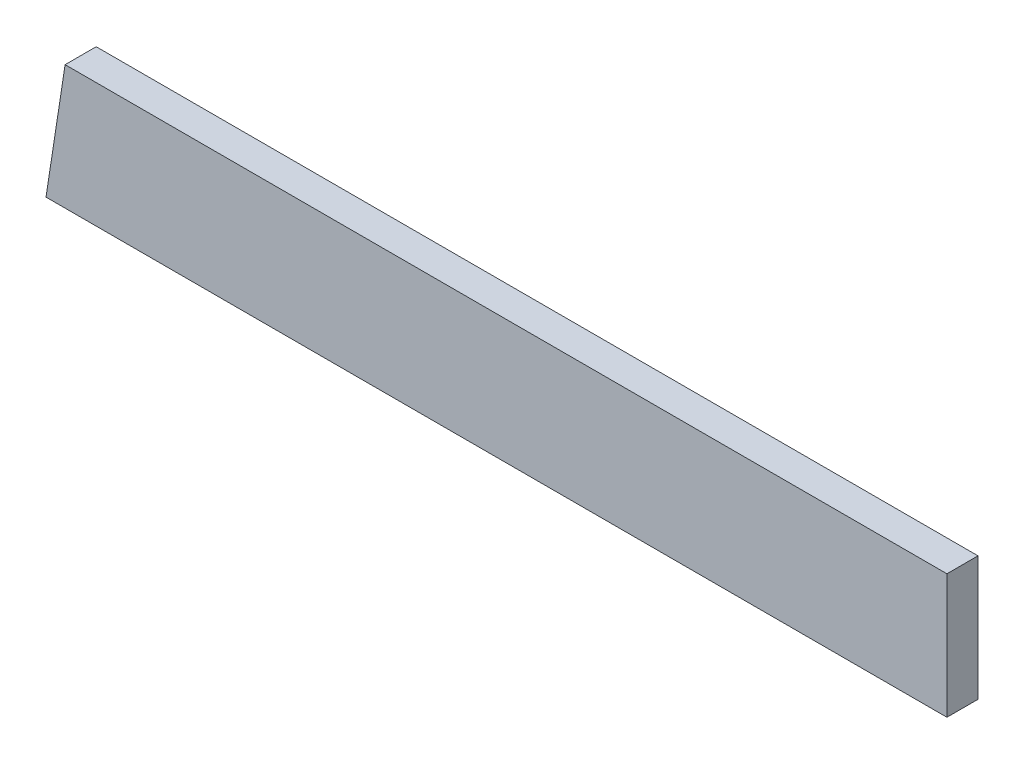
ISO-10303-21;
HEADER;
FILE_DESCRIPTION(('STEP AP214'),'2;1');
FILE_NAME('part.step','',(''),(''),'','','');
FILE_SCHEMA(('AUTOMOTIVE_DESIGN { 1 0 10303 214 1 1 1 1 }'));
ENDSEC;
DATA;
#1=APPLICATION_CONTEXT('core data for automotive mechanical design processes');
#2=APPLICATION_PROTOCOL_DEFINITION('international standard','automotive_design',2000,#1);
#3=PRODUCT_CONTEXT('',#1,'mechanical');
#4=PRODUCT('Part','Part','',(#3));
#5=PRODUCT_RELATED_PRODUCT_CATEGORY('part','',(#4));
#6=PRODUCT_DEFINITION_FORMATION('','',#4);
#7=PRODUCT_DEFINITION_CONTEXT('part definition',#1,'design');
#8=PRODUCT_DEFINITION('design','',#6,#7);
#9=PRODUCT_DEFINITION_SHAPE('','',#8);
#10=(LENGTH_UNIT() NAMED_UNIT(*) SI_UNIT(.MILLI.,.METRE.));
#11=(NAMED_UNIT(*) PLANE_ANGLE_UNIT() SI_UNIT($,.RADIAN.));
#12=(NAMED_UNIT(*) SI_UNIT($,.STERADIAN.) SOLID_ANGLE_UNIT());
#13=UNCERTAINTY_MEASURE_WITH_UNIT(LENGTH_MEASURE(1.E-05),#10,'distance_accuracy_value','');
#14=(GEOMETRIC_REPRESENTATION_CONTEXT(3) GLOBAL_UNCERTAINTY_ASSIGNED_CONTEXT((#13)) GLOBAL_UNIT_ASSIGNED_CONTEXT((#10,
#11,#12)) REPRESENTATION_CONTEXT('',''));
#15=CARTESIAN_POINT('',(0.,0.,0.));
#16=DIRECTION('',(0.,0.,1.));
#17=DIRECTION('',(1.,0.,0.));
#18=AXIS2_PLACEMENT_3D('',#15,#16,#17);
#19=CARTESIAN_POINT('',(-1101.96923076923,-1270.,25.4));
#20=DIRECTION('',(0.988371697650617,-0.152057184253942,0.));
#21=DIRECTION('',(0.152057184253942,0.988371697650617,0.));
#22=AXIS2_PLACEMENT_3D('',#19,#20,#21);
#23=PLANE('',#22);
#24=DIRECTION('',(-0.152057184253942,-0.988371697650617,0.));
#25=VECTOR('',#24,1.);
#26=CARTESIAN_POINT('',(-1101.96923076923,-1270.,0.));
#27=LINE('',#26,#25);
#28=CARTESIAN_POINT('',(-1101.96923076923,-1270.,0.));
#29=VERTEX_POINT('',#28);
#30=CARTESIAN_POINT('',(-1117.6,-1371.6,0.));
#31=VERTEX_POINT('',#30);
#32=EDGE_CURVE('E107',#29,#31,#27,.T.);
#33=ORIENTED_EDGE('',*,*,#32,.T.);
#34=DIRECTION('',(0.,0.,-1.));
#35=VECTOR('',#34,1.);
#36=CARTESIAN_POINT('',(-1117.6,-1371.6,25.4));
#37=LINE('',#36,#35);
#38=CARTESIAN_POINT('',(-1117.6,-1371.6,25.4));
#39=VERTEX_POINT('',#38);
#40=EDGE_CURVE('E11',#39,#31,#37,.T.);
#41=ORIENTED_EDGE('',*,*,#40,.F.);
#42=DIRECTION('',(-0.152057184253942,-0.988371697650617,0.));
#43=VECTOR('',#42,1.);
#44=CARTESIAN_POINT('',(-1101.96923076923,-1270.,25.4));
#45=LINE('',#44,#43);
#46=CARTESIAN_POINT('',(-1101.96923076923,-1270.,25.4));
#47=VERTEX_POINT('',#46);
#48=EDGE_CURVE('E89',#47,#39,#45,.T.);
#49=ORIENTED_EDGE('',*,*,#48,.F.);
#50=DIRECTION('',(0.,0.,-1.));
#51=VECTOR('',#50,1.);
#52=CARTESIAN_POINT('',(-1101.96923076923,-1270.,25.4));
#53=LINE('',#52,#51);
#54=EDGE_CURVE('E56',#47,#29,#53,.T.);
#55=ORIENTED_EDGE('',*,*,#54,.T.);
#56=EDGE_LOOP('',(#33,#41,#49,#55));
#57=FACE_BOUND('',#56,.T.);
#58=ADVANCED_FACE('F39',(#57),#23,.F.);
#59=CARTESIAN_POINT('',(-1117.6,-1371.6,25.4));
#60=DIRECTION('',(0.,1.,0.));
#61=DIRECTION('',(0.,0.,1.));
#62=AXIS2_PLACEMENT_3D('',#59,#60,#61);
#63=PLANE('',#62);
#64=DIRECTION('',(1.,0.,0.));
#65=VECTOR('',#64,1.);
#66=CARTESIAN_POINT('',(-1117.6,-1371.6,0.));
#67=LINE('',#66,#65);
#68=CARTESIAN_POINT('',(-381.117230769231,-1371.6,0.));
#69=VERTEX_POINT('',#68);
#70=EDGE_CURVE('E95',#31,#69,#67,.T.);
#71=ORIENTED_EDGE('',*,*,#70,.T.);
#72=DIRECTION('',(0.,0.,-1.));
#73=VECTOR('',#72,1.);
#74=CARTESIAN_POINT('',(-381.117230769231,-1371.6,25.4));
#75=LINE('',#74,#73);
#76=CARTESIAN_POINT('',(-381.117230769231,-1371.6,25.4));
#77=VERTEX_POINT('',#76);
#78=EDGE_CURVE('E48',#77,#69,#75,.T.);
#79=ORIENTED_EDGE('',*,*,#78,.F.);
#80=DIRECTION('',(1.,0.,0.));
#81=VECTOR('',#80,1.);
#82=CARTESIAN_POINT('',(-1117.6,-1371.6,25.4));
#83=LINE('',#82,#81);
#84=EDGE_CURVE('E81',#39,#77,#83,.T.);
#85=ORIENTED_EDGE('',*,*,#84,.F.);
#86=ORIENTED_EDGE('',*,*,#40,.T.);
#87=EDGE_LOOP('',(#71,#79,#85,#86));
#88=FACE_BOUND('',#87,.T.);
#89=ADVANCED_FACE('F94',(#88),#63,.F.);
#90=CARTESIAN_POINT('',(-381.117230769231,-1270.,25.4));
#91=DIRECTION('',(1.,0.,0.));
#92=DIRECTION('',(0.,0.,-1.));
#93=AXIS2_PLACEMENT_3D('',#90,#91,#92);
#94=PLANE('',#93);
#95=DIRECTION('',(0.,-1.,0.));
#96=VECTOR('',#95,1.);
#97=CARTESIAN_POINT('',(-381.117230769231,-1270.,0.));
#98=LINE('',#97,#96);
#99=CARTESIAN_POINT('',(-381.117230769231,-1270.,0.));
#100=VERTEX_POINT('',#99);
#101=EDGE_CURVE('E112',#100,#69,#98,.T.);
#102=ORIENTED_EDGE('',*,*,#101,.F.);
#103=DIRECTION('',(0.,0.,-1.));
#104=VECTOR('',#103,1.);
#105=CARTESIAN_POINT('',(-381.117230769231,-1270.,25.4));
#106=LINE('',#105,#104);
#107=CARTESIAN_POINT('',(-381.117230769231,-1270.,25.4));
#108=VERTEX_POINT('',#107);
#109=EDGE_CURVE('E70',#108,#100,#106,.T.);
#110=ORIENTED_EDGE('',*,*,#109,.F.);
#111=DIRECTION('',(0.,-1.,0.));
#112=VECTOR('',#111,1.);
#113=CARTESIAN_POINT('',(-381.117230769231,-1270.,25.4));
#114=LINE('',#113,#112);
#115=EDGE_CURVE('E88',#108,#77,#114,.T.);
#116=ORIENTED_EDGE('',*,*,#115,.T.);
#117=ORIENTED_EDGE('',*,*,#78,.T.);
#118=EDGE_LOOP('',(#102,#110,#116,#117));
#119=FACE_BOUND('',#118,.T.);
#120=ADVANCED_FACE('F99',(#119),#94,.T.);
#121=CARTESIAN_POINT('',(-1101.96923076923,-1270.,25.4));
#122=DIRECTION('',(0.,1.,0.));
#123=DIRECTION('',(-1.,0.,0.));
#124=AXIS2_PLACEMENT_3D('',#121,#122,#123);
#125=PLANE('',#124);
#126=DIRECTION('',(1.,0.,0.));
#127=VECTOR('',#126,1.);
#128=CARTESIAN_POINT('',(-1101.96923076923,-1270.,0.));
#129=LINE('',#128,#127);
#130=EDGE_CURVE('E115',#29,#100,#129,.T.);
#131=ORIENTED_EDGE('',*,*,#130,.F.);
#132=ORIENTED_EDGE('',*,*,#54,.F.);
#133=DIRECTION('',(1.,0.,0.));
#134=VECTOR('',#133,1.);
#135=CARTESIAN_POINT('',(-1101.96923076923,-1270.,25.4));
#136=LINE('',#135,#134);
#137=EDGE_CURVE('E101',#47,#108,#136,.T.);
#138=ORIENTED_EDGE('',*,*,#137,.T.);
#139=ORIENTED_EDGE('',*,*,#109,.T.);
#140=EDGE_LOOP('',(#131,#132,#138,#139));
#141=FACE_BOUND('',#140,.T.);
#142=ADVANCED_FACE('F125',(#141),#125,.T.);
#143=CARTESIAN_POINT('',(0.,0.,25.4));
#144=DIRECTION('',(0.,0.,1.));
#145=DIRECTION('',(1.,0.,0.));
#146=AXIS2_PLACEMENT_3D('',#143,#144,#145);
#147=PLANE('',#146);
#148=ORIENTED_EDGE('',*,*,#48,.T.);
#149=ORIENTED_EDGE('',*,*,#84,.T.);
#150=ORIENTED_EDGE('',*,*,#115,.F.);
#151=ORIENTED_EDGE('',*,*,#137,.F.);
#152=EDGE_LOOP('',(#148,#149,#150,#151));
#153=FACE_BOUND('',#152,.T.);
#154=ADVANCED_FACE('F85',(#153),#147,.T.);
#155=CARTESIAN_POINT('',(0.,0.,0.));
#156=DIRECTION('',(0.,0.,1.));
#157=DIRECTION('',(1.,0.,0.));
#158=AXIS2_PLACEMENT_3D('',#155,#156,#157);
#159=PLANE('',#158);
#160=ORIENTED_EDGE('',*,*,#32,.F.);
#161=ORIENTED_EDGE('',*,*,#130,.T.);
#162=ORIENTED_EDGE('',*,*,#101,.T.);
#163=ORIENTED_EDGE('',*,*,#70,.F.);
#164=EDGE_LOOP('',(#160,#161,#162,#163));
#165=FACE_BOUND('',#164,.T.);
#166=ADVANCED_FACE('F124',(#165),#159,.F.);
#167=CLOSED_SHELL('',(#58,#89,#120,#142,#154,#166));
#168=MANIFOLD_SOLID_BREP('B2',#167);
#169=ADVANCED_BREP_SHAPE_REPRESENTATION('',(#18,#168),#14);
#170=SHAPE_DEFINITION_REPRESENTATION(#9,#169);
ENDSEC;
END-ISO-10303-21;
